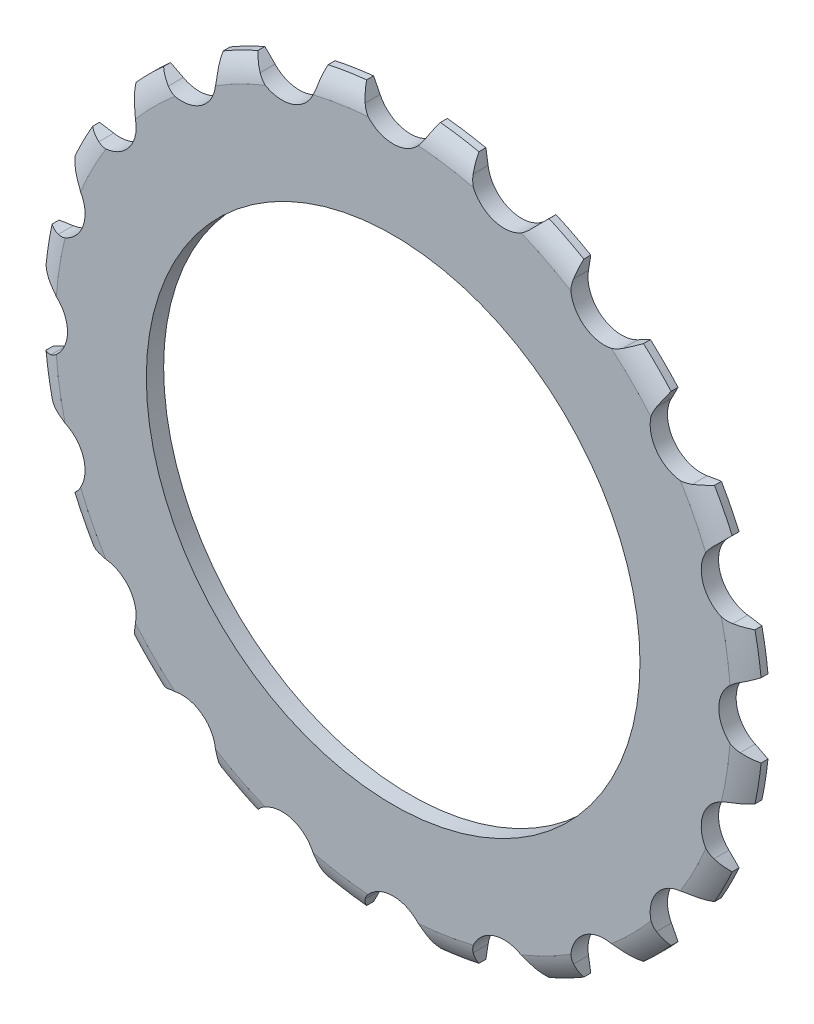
from build123d import *

# Parameters (mm, degrees)
EXTRUDE1_DEPTH    = 59.702129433
CIRPATTERN1_COUNT = 20


with BuildPart() as part:
    # Sketch2 → Revolve1 (revolve)
    with BuildSketch(Plane(origin=(0, 0, 0), x_dir=(0, 0, -1), z_dir=(1, 0, 0)), mode=Mode.PRIVATE) as revolve1_sk:
        with BuildLine():
            Line((-1.2, 28.5), (0.8, 28.5))
            Line((0.8, 28.5), (0.8, 41.5))
            Line((0.8, 41.5), (0, 41.5))
            ThreePointArc((0, 41.5), (-0.760147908, 40.326870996), (-1.2, 39))
            Line((-1.2, 39), (-1.2, 28.5))
        make_face()
    revolve(revolve1_sk.sketch.rotate(Axis((0, 0, -80.9), (0, 0, 1)), 90), axis=Axis((0, 0, -80.9), (0, 0, 1)))

    # Sketch1 → Extrude1 (cut, symmetric)
    with BuildSketch(Plane.XY):
        with BuildLine():
            ThreePointArc((-5.782452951, 43.971419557), (-4.596558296, 41.910675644), (-3.508385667, 39.796700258))
            ThreePointArc((-3.508385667, 39.796700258), (0, 37.6), (3.508385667, 39.796700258))
            ThreePointArc((3.508385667, 39.796700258), (4.596558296, 41.910675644), (5.782452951, 43.971419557))
            ThreePointArc((5.782452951, 43.971419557), (0, 44.35), (-5.782452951, 43.971419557))
        make_face()
    extrude1 = extrude(amount=EXTRUDE1_DEPTH, both=True, mode=Mode.SUBTRACT)

    # CirPattern1: Extrude1 ×20 about axis
    cirpattern1_axis = Axis((0, 0, 0), (0, 0, 1))
    for i in range(1, CIRPATTERN1_COUNT):
        add(extrude1.rotate(cirpattern1_axis, i * 360 / CIRPATTERN1_COUNT), mode=Mode.SUBTRACT)


solid = part.part
